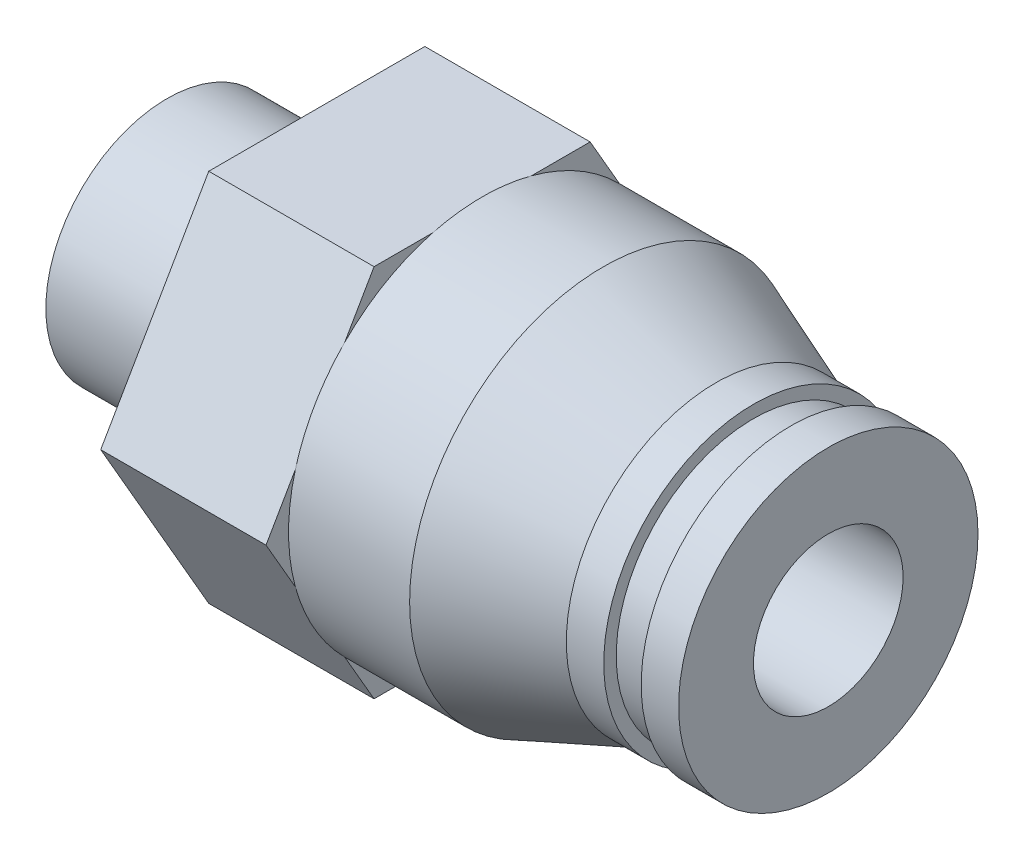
ISO-10303-21;
HEADER;
FILE_DESCRIPTION(('STEP AP214'),'2;1');
FILE_NAME('part.step','',(''),(''),'','','');
FILE_SCHEMA(('AUTOMOTIVE_DESIGN { 1 0 10303 214 1 1 1 1 }'));
ENDSEC;
DATA;
#1=APPLICATION_CONTEXT('core data for automotive mechanical design processes');
#2=APPLICATION_PROTOCOL_DEFINITION('international standard','automotive_design',2000,#1);
#3=PRODUCT_CONTEXT('',#1,'mechanical');
#4=PRODUCT('Part','Part','',(#3));
#5=PRODUCT_RELATED_PRODUCT_CATEGORY('part','',(#4));
#6=PRODUCT_DEFINITION_FORMATION('','',#4);
#7=PRODUCT_DEFINITION_CONTEXT('part definition',#1,'design');
#8=PRODUCT_DEFINITION('design','',#6,#7);
#9=PRODUCT_DEFINITION_SHAPE('','',#8);
#10=(LENGTH_UNIT() NAMED_UNIT(*) SI_UNIT(.MILLI.,.METRE.));
#11=(NAMED_UNIT(*) PLANE_ANGLE_UNIT() SI_UNIT($,.RADIAN.));
#12=(NAMED_UNIT(*) SI_UNIT($,.STERADIAN.) SOLID_ANGLE_UNIT());
#13=UNCERTAINTY_MEASURE_WITH_UNIT(LENGTH_MEASURE(1.E-05),#10,'distance_accuracy_value','');
#14=(GEOMETRIC_REPRESENTATION_CONTEXT(3) GLOBAL_UNCERTAINTY_ASSIGNED_CONTEXT((#13)) GLOBAL_UNIT_ASSIGNED_CONTEXT((#10,
#11,#12)) REPRESENTATION_CONTEXT('',''));
#15=CARTESIAN_POINT('',(0.,0.,0.));
#16=DIRECTION('',(0.,0.,1.));
#17=DIRECTION('',(1.,0.,0.));
#18=AXIS2_PLACEMENT_3D('',#15,#16,#17);
#19=CARTESIAN_POINT('',(6.,4.86,0.));
#20=DIRECTION('',(-1.,0.,0.));
#21=DIRECTION('',(0.,0.,1.));
#22=AXIS2_PLACEMENT_3D('',#19,#20,#21);
#23=PLANE('',#22);
#24=CARTESIAN_POINT('',(6.,0.,0.));
#25=DIRECTION('',(1.,0.,0.));
#26=DIRECTION('',(0.,0.,-1.));
#27=AXIS2_PLACEMENT_3D('',#24,#25,#26);
#28=CIRCLE('',#27,4.86);
#29=CARTESIAN_POINT('',(6.,0.,-4.86));
#30=VERTEX_POINT('',#29);
#31=EDGE_CURVE('E279',#30,#30,#28,.T.);
#32=ORIENTED_EDGE('',*,*,#31,.T.);
#33=EDGE_LOOP('',(#32));
#34=FACE_BOUND('',#33,.T.);
#35=DIRECTION('',(0.,-0.866025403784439,0.5));
#36=VECTOR('',#35,1.);
#37=CARTESIAN_POINT('',(6.,0.,-8.66025403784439));
#38=LINE('',#37,#36);
#39=CARTESIAN_POINT('',(6.,0.,-8.66025403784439));
#40=VERTEX_POINT('',#39);
#41=CARTESIAN_POINT('',(6.,-7.5,-4.33012701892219));
#42=VERTEX_POINT('',#41);
#43=EDGE_CURVE('E173',#40,#42,#38,.T.);
#44=ORIENTED_EDGE('',*,*,#43,.T.);
#45=DIRECTION('',(0.,0.,1.));
#46=VECTOR('',#45,1.);
#47=CARTESIAN_POINT('',(6.,-7.5,-4.33012701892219));
#48=LINE('',#47,#46);
#49=CARTESIAN_POINT('',(6.,-7.5,4.3301270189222));
#50=VERTEX_POINT('',#49);
#51=EDGE_CURVE('E155',#42,#50,#48,.T.);
#52=ORIENTED_EDGE('',*,*,#51,.T.);
#53=DIRECTION('',(0.,0.866025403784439,0.5));
#54=VECTOR('',#53,1.);
#55=CARTESIAN_POINT('',(6.,-7.5,4.3301270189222));
#56=LINE('',#55,#54);
#57=CARTESIAN_POINT('',(6.,0.,8.66025403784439));
#58=VERTEX_POINT('',#57);
#59=EDGE_CURVE('E167',#50,#58,#56,.T.);
#60=ORIENTED_EDGE('',*,*,#59,.T.);
#61=DIRECTION('',(0.,0.866025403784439,-0.5));
#62=VECTOR('',#61,1.);
#63=CARTESIAN_POINT('',(6.,0.,8.66025403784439));
#64=LINE('',#63,#62);
#65=CARTESIAN_POINT('',(6.,7.5,4.33012701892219));
#66=VERTEX_POINT('',#65);
#67=EDGE_CURVE('E39',#58,#66,#64,.T.);
#68=ORIENTED_EDGE('',*,*,#67,.T.);
#69=DIRECTION('',(0.,0.,-1.));
#70=VECTOR('',#69,1.);
#71=CARTESIAN_POINT('',(6.,7.5,4.33012701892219));
#72=LINE('',#71,#70);
#73=CARTESIAN_POINT('',(6.,7.5,-4.3301270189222));
#74=VERTEX_POINT('',#73);
#75=EDGE_CURVE('E177',#66,#74,#72,.T.);
#76=ORIENTED_EDGE('',*,*,#75,.T.);
#77=DIRECTION('',(0.,-0.866025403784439,-0.5));
#78=VECTOR('',#77,1.);
#79=CARTESIAN_POINT('',(6.,7.5,-4.3301270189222));
#80=LINE('',#79,#78);
#81=EDGE_CURVE('E180',#74,#40,#80,.T.);
#82=ORIENTED_EDGE('',*,*,#81,.T.);
#83=EDGE_LOOP('',(#44,#52,#60,#68,#76,#82));
#84=FACE_BOUND('',#83,.T.);
#85=ADVANCED_FACE('F24',(#34,#84),#23,.T.);
#86=CARTESIAN_POINT('',(12.625,9.5,0.));
#87=DIRECTION('',(1.,0.,0.));
#88=DIRECTION('',(0.,0.,-1.));
#89=AXIS2_PLACEMENT_3D('',#86,#87,#88);
#90=PLANE('',#89);
#91=CARTESIAN_POINT('',(12.625,0.,0.));
#92=DIRECTION('',(1.,0.,0.));
#93=DIRECTION('',(0.,0.,-1.));
#94=AXIS2_PLACEMENT_3D('',#91,#92,#93);
#95=CIRCLE('',#94,7.75688111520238);
#96=CARTESIAN_POINT('',(12.625,-7.5,-1.97969811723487));
#97=VERTEX_POINT('',#96);
#98=CARTESIAN_POINT('',(12.625,-5.46446886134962,-5.50534146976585));
#99=VERTEX_POINT('',#98);
#100=EDGE_CURVE('E390',#97,#99,#95,.T.);
#101=ORIENTED_EDGE('',*,*,#100,.F.);
#102=DIRECTION('',(0.,0.,1.));
#103=VECTOR('',#102,1.);
#104=CARTESIAN_POINT('',(12.625,-7.5,-4.33012701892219));
#105=LINE('',#104,#103);
#106=CARTESIAN_POINT('',(12.625,-7.5,-4.33012701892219));
#107=VERTEX_POINT('',#106);
#108=EDGE_CURVE('E183',#107,#97,#105,.T.);
#109=ORIENTED_EDGE('',*,*,#108,.F.);
#110=DIRECTION('',(0.,-0.866025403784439,0.5));
#111=VECTOR('',#110,1.);
#112=CARTESIAN_POINT('',(12.625,0.,-8.66025403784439));
#113=LINE('',#112,#111);
#114=EDGE_CURVE('E203',#99,#107,#113,.T.);
#115=ORIENTED_EDGE('',*,*,#114,.F.);
#116=EDGE_LOOP('',(#101,#109,#115));
#117=FACE_BOUND('',#116,.T.);
#118=ADVANCED_FACE('F334',(#117),#90,.T.);
#119=CARTESIAN_POINT('',(12.625,-2.03553113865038,-7.48503958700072));
#120=VERTEX_POINT('',#119);
#121=CARTESIAN_POINT('',(12.625,2.03553113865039,-7.48503958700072));
#122=VERTEX_POINT('',#121);
#123=EDGE_CURVE('E275',#120,#122,#95,.T.);
#124=ORIENTED_EDGE('',*,*,#123,.F.);
#125=CARTESIAN_POINT('',(12.625,0.,-8.66025403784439));
#126=VERTEX_POINT('',#125);
#127=EDGE_CURVE('E164',#126,#120,#113,.T.);
#128=ORIENTED_EDGE('',*,*,#127,.F.);
#129=DIRECTION('',(0.,-0.866025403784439,-0.5));
#130=VECTOR('',#129,1.);
#131=CARTESIAN_POINT('',(12.625,7.5,-4.3301270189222));
#132=LINE('',#131,#130);
#133=EDGE_CURVE('E198',#122,#126,#132,.T.);
#134=ORIENTED_EDGE('',*,*,#133,.F.);
#135=EDGE_LOOP('',(#124,#128,#134));
#136=FACE_BOUND('',#135,.T.);
#137=ADVANCED_FACE('F340',(#136),#90,.T.);
#138=CARTESIAN_POINT('',(12.625,5.46446886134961,-5.50534146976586));
#139=VERTEX_POINT('',#138);
#140=CARTESIAN_POINT('',(12.625,7.5,-1.97969811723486));
#141=VERTEX_POINT('',#140);
#142=EDGE_CURVE('E280',#139,#141,#95,.T.);
#143=ORIENTED_EDGE('',*,*,#142,.F.);
#144=CARTESIAN_POINT('',(12.625,7.5,-4.3301270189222));
#145=VERTEX_POINT('',#144);
#146=EDGE_CURVE('E200',#145,#139,#132,.T.);
#147=ORIENTED_EDGE('',*,*,#146,.F.);
#148=DIRECTION('',(0.,0.,-1.));
#149=VECTOR('',#148,1.);
#150=CARTESIAN_POINT('',(12.625,7.5,4.33012701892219));
#151=LINE('',#150,#149);
#152=EDGE_CURVE('E193',#141,#145,#151,.T.);
#153=ORIENTED_EDGE('',*,*,#152,.F.);
#154=EDGE_LOOP('',(#143,#147,#153));
#155=FACE_BOUND('',#154,.T.);
#156=ADVANCED_FACE('F452',(#155),#90,.T.);
#157=CARTESIAN_POINT('',(12.625,7.5,1.97969811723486));
#158=VERTEX_POINT('',#157);
#159=CARTESIAN_POINT('',(12.625,5.46446886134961,5.50534146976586));
#160=VERTEX_POINT('',#159);
#161=EDGE_CURVE('E387',#158,#160,#95,.T.);
#162=ORIENTED_EDGE('',*,*,#161,.F.);
#163=CARTESIAN_POINT('',(12.625,7.5,4.33012701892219));
#164=VERTEX_POINT('',#163);
#165=EDGE_CURVE('E195',#164,#158,#151,.T.);
#166=ORIENTED_EDGE('',*,*,#165,.F.);
#167=DIRECTION('',(0.,0.866025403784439,-0.5));
#168=VECTOR('',#167,1.);
#169=CARTESIAN_POINT('',(12.625,0.,8.66025403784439));
#170=LINE('',#169,#168);
#171=EDGE_CURVE('E190',#160,#164,#170,.T.);
#172=ORIENTED_EDGE('',*,*,#171,.F.);
#173=EDGE_LOOP('',(#162,#166,#172));
#174=FACE_BOUND('',#173,.T.);
#175=ADVANCED_FACE('F370',(#174),#90,.T.);
#176=CARTESIAN_POINT('',(12.625,2.03553113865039,7.48503958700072));
#177=VERTEX_POINT('',#176);
#178=CARTESIAN_POINT('',(12.625,-2.03553113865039,7.48503958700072));
#179=VERTEX_POINT('',#178);
#180=EDGE_CURVE('E381',#177,#179,#95,.T.);
#181=ORIENTED_EDGE('',*,*,#180,.F.);
#182=CARTESIAN_POINT('',(12.625,0.,8.66025403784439));
#183=VERTEX_POINT('',#182);
#184=EDGE_CURVE('E45',#183,#177,#170,.T.);
#185=ORIENTED_EDGE('',*,*,#184,.F.);
#186=DIRECTION('',(0.,0.866025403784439,0.5));
#187=VECTOR('',#186,1.);
#188=CARTESIAN_POINT('',(12.625,-7.5,4.3301270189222));
#189=LINE('',#188,#187);
#190=EDGE_CURVE('E186',#179,#183,#189,.T.);
#191=ORIENTED_EDGE('',*,*,#190,.F.);
#192=EDGE_LOOP('',(#181,#185,#191));
#193=FACE_BOUND('',#192,.T.);
#194=ADVANCED_FACE('F365',(#193),#90,.T.);
#195=CARTESIAN_POINT('',(12.625,-7.5,4.3301270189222));
#196=VERTEX_POINT('',#195);
#197=CARTESIAN_POINT('',(12.625,-5.46446886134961,5.50534146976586));
#198=VERTEX_POINT('',#197);
#199=EDGE_CURVE('E188',#196,#198,#189,.T.);
#200=ORIENTED_EDGE('',*,*,#199,.F.);
#201=CARTESIAN_POINT('',(12.625,-7.5,1.97969811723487));
#202=VERTEX_POINT('',#201);
#203=EDGE_CURVE('E159',#202,#196,#105,.T.);
#204=ORIENTED_EDGE('',*,*,#203,.F.);
#205=EDGE_CURVE('E374',#198,#202,#95,.T.);
#206=ORIENTED_EDGE('',*,*,#205,.F.);
#207=EDGE_LOOP('',(#200,#204,#206));
#208=FACE_BOUND('',#207,.T.);
#209=ADVANCED_FACE('F343',(#208),#90,.T.);
#210=CARTESIAN_POINT('',(0.,0.,0.));
#211=DIRECTION('',(-1.,0.,0.));
#212=DIRECTION('',(0.,0.,1.));
#213=AXIS2_PLACEMENT_3D('',#210,#211,#212);
#214=PLANE('',#213);
#215=CARTESIAN_POINT('',(0.,0.,0.));
#216=DIRECTION('',(1.,0.,0.));
#217=DIRECTION('',(0.,0.,-1.));
#218=AXIS2_PLACEMENT_3D('',#215,#216,#217);
#219=CIRCLE('',#218,4.86);
#220=CARTESIAN_POINT('',(0.,0.,-4.86));
#221=VERTEX_POINT('',#220);
#222=EDGE_CURVE('E283',#221,#221,#219,.T.);
#223=ORIENTED_EDGE('',*,*,#222,.F.);
#224=EDGE_LOOP('',(#223));
#225=FACE_BOUND('',#224,.T.);
#226=DIRECTION('',(0.,-0.866025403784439,-0.5));
#227=VECTOR('',#226,1.);
#228=CARTESIAN_POINT('',(0.,0.,2.88675134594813));
#229=LINE('',#228,#227);
#230=CARTESIAN_POINT('',(0.,0.,2.88675134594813));
#231=VERTEX_POINT('',#230);
#232=CARTESIAN_POINT('',(0.,-2.5,1.44337567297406));
#233=VERTEX_POINT('',#232);
#234=EDGE_CURVE('E232',#231,#233,#229,.T.);
#235=ORIENTED_EDGE('',*,*,#234,.T.);
#236=DIRECTION('',(0.,0.,-1.));
#237=VECTOR('',#236,1.);
#238=CARTESIAN_POINT('',(0.,-2.5,1.44337567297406));
#239=LINE('',#238,#237);
#240=CARTESIAN_POINT('',(0.,-2.5,-1.44337567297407));
#241=VERTEX_POINT('',#240);
#242=EDGE_CURVE('E210',#233,#241,#239,.T.);
#243=ORIENTED_EDGE('',*,*,#242,.T.);
#244=DIRECTION('',(0.,0.866025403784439,-0.5));
#245=VECTOR('',#244,1.);
#246=CARTESIAN_POINT('',(0.,-2.5,-1.44337567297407));
#247=LINE('',#246,#245);
#248=CARTESIAN_POINT('',(0.,0.,-2.88675134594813));
#249=VERTEX_POINT('',#248);
#250=EDGE_CURVE('E220',#241,#249,#247,.T.);
#251=ORIENTED_EDGE('',*,*,#250,.T.);
#252=DIRECTION('',(0.,0.866025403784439,0.5));
#253=VECTOR('',#252,1.);
#254=CARTESIAN_POINT('',(0.,0.,-2.88675134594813));
#255=LINE('',#254,#253);
#256=CARTESIAN_POINT('',(0.,2.5,-1.44337567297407));
#257=VERTEX_POINT('',#256);
#258=EDGE_CURVE('E223',#249,#257,#255,.T.);
#259=ORIENTED_EDGE('',*,*,#258,.T.);
#260=DIRECTION('',(0.,0.,1.));
#261=VECTOR('',#260,1.);
#262=CARTESIAN_POINT('',(0.,2.5,-1.44337567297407));
#263=LINE('',#262,#261);
#264=CARTESIAN_POINT('',(0.,2.5,1.44337567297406));
#265=VERTEX_POINT('',#264);
#266=EDGE_CURVE('E226',#257,#265,#263,.T.);
#267=ORIENTED_EDGE('',*,*,#266,.T.);
#268=DIRECTION('',(0.,-0.866025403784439,0.5));
#269=VECTOR('',#268,1.);
#270=CARTESIAN_POINT('',(0.,2.5,1.44337567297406));
#271=LINE('',#270,#269);
#272=EDGE_CURVE('E229',#265,#231,#271,.T.);
#273=ORIENTED_EDGE('',*,*,#272,.T.);
#274=EDGE_LOOP('',(#235,#243,#251,#259,#267,#273));
#275=FACE_BOUND('',#274,.T.);
#276=ADVANCED_FACE('F26',(#225,#275),#214,.T.);
#277=CARTESIAN_POINT('',(9.,3.,0.));
#278=DIRECTION('',(1.,0.,0.));
#279=DIRECTION('',(0.,0.,-1.));
#280=AXIS2_PLACEMENT_3D('',#277,#278,#279);
#281=PLANE('',#280);
#282=CARTESIAN_POINT('',(9.,0.,0.));
#283=DIRECTION('',(1.,0.,0.));
#284=DIRECTION('',(0.,0.,-1.));
#285=AXIS2_PLACEMENT_3D('',#282,#283,#284);
#286=CIRCLE('',#285,3.);
#287=CARTESIAN_POINT('',(9.,0.,-3.));
#288=VERTEX_POINT('',#287);
#289=EDGE_CURVE('E248',#288,#288,#286,.T.);
#290=ORIENTED_EDGE('',*,*,#289,.T.);
#291=EDGE_LOOP('',(#290));
#292=FACE_BOUND('',#291,.T.);
#293=DIRECTION('',(0.,-0.866025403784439,0.5));
#294=VECTOR('',#293,1.);
#295=CARTESIAN_POINT('',(9.,1.,-3.46410161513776));
#296=LINE('',#295,#294);
#297=CARTESIAN_POINT('',(9.,0.,-2.88675134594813));
#298=VERTEX_POINT('',#297);
#299=CARTESIAN_POINT('',(9.,-2.5,-1.44337567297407));
#300=VERTEX_POINT('',#299);
#301=EDGE_CURVE('E32',#298,#300,#296,.T.);
#302=ORIENTED_EDGE('',*,*,#301,.T.);
#303=DIRECTION('',(0.,0.,1.));
#304=VECTOR('',#303,1.);
#305=CARTESIAN_POINT('',(9.,-2.5,0.));
#306=LINE('',#305,#304);
#307=CARTESIAN_POINT('',(9.,-2.5,1.44337567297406));
#308=VERTEX_POINT('',#307);
#309=EDGE_CURVE('E13',#300,#308,#306,.T.);
#310=ORIENTED_EDGE('',*,*,#309,.T.);
#311=DIRECTION('',(0.,0.866025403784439,0.5));
#312=VECTOR('',#311,1.);
#313=CARTESIAN_POINT('',(9.,1.,3.46410161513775));
#314=LINE('',#313,#312);
#315=CARTESIAN_POINT('',(9.,0.,2.88675134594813));
#316=VERTEX_POINT('',#315);
#317=EDGE_CURVE('E286',#308,#316,#314,.T.);
#318=ORIENTED_EDGE('',*,*,#317,.T.);
#319=DIRECTION('',(0.,0.866025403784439,-0.5));
#320=VECTOR('',#319,1.);
#321=CARTESIAN_POINT('',(9.,3.5,0.866025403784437));
#322=LINE('',#321,#320);
#323=CARTESIAN_POINT('',(9.,2.5,1.44337567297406));
#324=VERTEX_POINT('',#323);
#325=EDGE_CURVE('E289',#316,#324,#322,.T.);
#326=ORIENTED_EDGE('',*,*,#325,.T.);
#327=DIRECTION('',(0.,0.,-1.));
#328=VECTOR('',#327,1.);
#329=CARTESIAN_POINT('',(9.,2.5,0.));
#330=LINE('',#329,#328);
#331=CARTESIAN_POINT('',(9.,2.5,-1.44337567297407));
#332=VERTEX_POINT('',#331);
#333=EDGE_CURVE('E292',#324,#332,#330,.T.);
#334=ORIENTED_EDGE('',*,*,#333,.T.);
#335=DIRECTION('',(0.,-0.866025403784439,-0.5));
#336=VECTOR('',#335,1.);
#337=CARTESIAN_POINT('',(9.,3.5,-0.866025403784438));
#338=LINE('',#337,#336);
#339=EDGE_CURVE('E295',#332,#298,#338,.T.);
#340=ORIENTED_EDGE('',*,*,#339,.T.);
#341=EDGE_LOOP('',(#302,#310,#318,#326,#334,#340));
#342=FACE_BOUND('',#341,.T.);
#343=ADVANCED_FACE('F299',(#292,#342),#281,.T.);
#344=CARTESIAN_POINT('',(0.,0.,0.));
#345=DIRECTION('',(1.,0.,0.));
#346=DIRECTION('',(0.,0.,-1.));
#347=AXIS2_PLACEMENT_3D('',#344,#345,#346);
#348=CYLINDRICAL_SURFACE('',#347,4.86);
#349=ORIENTED_EDGE('',*,*,#222,.T.);
#350=EDGE_LOOP('',(#349));
#351=FACE_BOUND('',#350,.T.);
#352=ORIENTED_EDGE('',*,*,#31,.F.);
#353=EDGE_LOOP('',(#352));
#354=FACE_BOUND('',#353,.T.);
#355=ADVANCED_FACE('F345',(#351,#354),#348,.T.);
#356=CARTESIAN_POINT('',(0.,0.,0.));
#357=DIRECTION('',(1.,0.,0.));
#358=DIRECTION('',(0.,0.,-1.));
#359=AXIS2_PLACEMENT_3D('',#356,#357,#358);
#360=CYLINDRICAL_SURFACE('',#359,7.75688111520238);
#361=EDGE_CURVE('E276',#122,#139,#95,.T.);
#362=ORIENTED_EDGE('',*,*,#361,.T.);
#363=ORIENTED_EDGE('',*,*,#142,.T.);
#364=EDGE_CURVE('E454',#141,#158,#95,.T.);
#365=ORIENTED_EDGE('',*,*,#364,.T.);
#366=ORIENTED_EDGE('',*,*,#161,.T.);
#367=EDGE_CURVE('E386',#160,#177,#95,.T.);
#368=ORIENTED_EDGE('',*,*,#367,.T.);
#369=ORIENTED_EDGE('',*,*,#180,.T.);
#370=EDGE_CURVE('E384',#179,#198,#95,.T.);
#371=ORIENTED_EDGE('',*,*,#370,.T.);
#372=ORIENTED_EDGE('',*,*,#205,.T.);
#373=EDGE_CURVE('E388',#202,#97,#95,.T.);
#374=ORIENTED_EDGE('',*,*,#373,.T.);
#375=ORIENTED_EDGE('',*,*,#100,.T.);
#376=EDGE_CURVE('E392',#99,#120,#95,.T.);
#377=ORIENTED_EDGE('',*,*,#376,.T.);
#378=ORIENTED_EDGE('',*,*,#123,.T.);
#379=EDGE_LOOP('',(#362,#363,#365,#366,#368,#369,#371,#372,#374,#375,#377,#378));
#380=FACE_BOUND('',#379,.T.);
#381=CARTESIAN_POINT('',(17.4771203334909,0.,0.));
#382=DIRECTION('',(1.,0.,0.));
#383=DIRECTION('',(0.,0.,-1.));
#384=AXIS2_PLACEMENT_3D('',#381,#382,#383);
#385=CIRCLE('',#384,7.75688111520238);
#386=CARTESIAN_POINT('',(17.4771203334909,0.,-7.75688111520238));
#387=VERTEX_POINT('',#386);
#388=EDGE_CURVE('E272',#387,#387,#385,.T.);
#389=ORIENTED_EDGE('',*,*,#388,.F.);
#390=EDGE_LOOP('',(#389));
#391=FACE_BOUND('',#390,.T.);
#392=ADVANCED_FACE('F347',(#380,#391),#360,.T.);
#393=CARTESIAN_POINT('',(22.,0.,0.));
#394=DIRECTION('',(-1.,0.,0.));
#395=DIRECTION('',(0.,0.,1.));
#396=AXIS2_PLACEMENT_3D('',#393,#394,#395);
#397=CONICAL_SURFACE('',#396,6.,0.370503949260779);
#398=ORIENTED_EDGE('',*,*,#388,.T.);
#399=EDGE_LOOP('',(#398));
#400=FACE_BOUND('',#399,.T.);
#401=CARTESIAN_POINT('',(22.,0.,0.));
#402=DIRECTION('',(1.,0.,0.));
#403=DIRECTION('',(0.,0.,-1.));
#404=AXIS2_PLACEMENT_3D('',#401,#402,#403);
#405=CIRCLE('',#404,6.);
#406=CARTESIAN_POINT('',(22.,0.,-6.));
#407=VERTEX_POINT('',#406);
#408=EDGE_CURVE('E269',#407,#407,#405,.T.);
#409=ORIENTED_EDGE('',*,*,#408,.F.);
#410=EDGE_LOOP('',(#409));
#411=FACE_BOUND('',#410,.T.);
#412=ADVANCED_FACE('F353',(#400,#411),#397,.T.);
#413=CARTESIAN_POINT('',(0.,0.,0.));
#414=DIRECTION('',(1.,0.,0.));
#415=DIRECTION('',(0.,0.,-1.));
#416=AXIS2_PLACEMENT_3D('',#413,#414,#415);
#417=CYLINDRICAL_SURFACE('',#416,6.);
#418=ORIENTED_EDGE('',*,*,#408,.T.);
#419=EDGE_LOOP('',(#418));
#420=FACE_BOUND('',#419,.T.);
#421=CARTESIAN_POINT('',(23.5,0.,0.));
#422=DIRECTION('',(1.,0.,0.));
#423=DIRECTION('',(0.,0.,-1.));
#424=AXIS2_PLACEMENT_3D('',#421,#422,#423);
#425=CIRCLE('',#424,6.);
#426=CARTESIAN_POINT('',(23.5,0.,-6.));
#427=VERTEX_POINT('',#426);
#428=EDGE_CURVE('E266',#427,#427,#425,.T.);
#429=ORIENTED_EDGE('',*,*,#428,.F.);
#430=EDGE_LOOP('',(#429));
#431=FACE_BOUND('',#430,.T.);
#432=ADVANCED_FACE('F615',(#420,#431),#417,.T.);
#433=CARTESIAN_POINT('',(23.5,6.,0.));
#434=DIRECTION('',(1.,0.,0.));
#435=DIRECTION('',(0.,0.,-1.));
#436=AXIS2_PLACEMENT_3D('',#433,#434,#435);
#437=PLANE('',#436);
#438=ORIENTED_EDGE('',*,*,#428,.T.);
#439=EDGE_LOOP('',(#438));
#440=FACE_BOUND('',#439,.T.);
#441=CARTESIAN_POINT('',(23.5,0.,0.));
#442=DIRECTION('',(1.,0.,0.));
#443=DIRECTION('',(0.,0.,-1.));
#444=AXIS2_PLACEMENT_3D('',#441,#442,#443);
#445=CIRCLE('',#444,5.5);
#446=CARTESIAN_POINT('',(23.5,0.,-5.5));
#447=VERTEX_POINT('',#446);
#448=EDGE_CURVE('E263',#447,#447,#445,.T.);
#449=ORIENTED_EDGE('',*,*,#448,.F.);
#450=EDGE_LOOP('',(#449));
#451=FACE_BOUND('',#450,.T.);
#452=ADVANCED_FACE('F605',(#440,#451),#437,.T.);
#453=CARTESIAN_POINT('',(0.,0.,0.));
#454=DIRECTION('',(1.,0.,0.));
#455=DIRECTION('',(0.,0.,-1.));
#456=AXIS2_PLACEMENT_3D('',#453,#454,#455);
#457=CYLINDRICAL_SURFACE('',#456,5.5);
#458=ORIENTED_EDGE('',*,*,#448,.T.);
#459=EDGE_LOOP('',(#458));
#460=FACE_BOUND('',#459,.T.);
#461=CARTESIAN_POINT('',(25.,0.,0.));
#462=DIRECTION('',(1.,0.,0.));
#463=DIRECTION('',(0.,0.,-1.));
#464=AXIS2_PLACEMENT_3D('',#461,#462,#463);
#465=CIRCLE('',#464,5.5);
#466=CARTESIAN_POINT('',(25.,0.,-5.5));
#467=VERTEX_POINT('',#466);
#468=EDGE_CURVE('E260',#467,#467,#465,.T.);
#469=ORIENTED_EDGE('',*,*,#468,.F.);
#470=EDGE_LOOP('',(#469));
#471=FACE_BOUND('',#470,.T.);
#472=ADVANCED_FACE('F594',(#460,#471),#457,.T.);
#473=CARTESIAN_POINT('',(25.,5.5,0.));
#474=DIRECTION('',(-1.,0.,0.));
#475=DIRECTION('',(0.,0.,1.));
#476=AXIS2_PLACEMENT_3D('',#473,#474,#475);
#477=PLANE('',#476);
#478=ORIENTED_EDGE('',*,*,#468,.T.);
#479=EDGE_LOOP('',(#478));
#480=FACE_BOUND('',#479,.T.);
#481=CARTESIAN_POINT('',(25.,0.,0.));
#482=DIRECTION('',(1.,0.,0.));
#483=DIRECTION('',(0.,0.,-1.));
#484=AXIS2_PLACEMENT_3D('',#481,#482,#483);
#485=CIRCLE('',#484,6.);
#486=CARTESIAN_POINT('',(25.,0.,-6.));
#487=VERTEX_POINT('',#486);
#488=EDGE_CURVE('E257',#487,#487,#485,.T.);
#489=ORIENTED_EDGE('',*,*,#488,.F.);
#490=EDGE_LOOP('',(#489));
#491=FACE_BOUND('',#490,.T.);
#492=ADVANCED_FACE('F583',(#480,#491),#477,.T.);
#493=CARTESIAN_POINT('',(0.,0.,0.));
#494=DIRECTION('',(1.,0.,0.));
#495=DIRECTION('',(0.,0.,-1.));
#496=AXIS2_PLACEMENT_3D('',#493,#494,#495);
#497=CYLINDRICAL_SURFACE('',#496,6.);
#498=ORIENTED_EDGE('',*,*,#488,.T.);
#499=EDGE_LOOP('',(#498));
#500=FACE_BOUND('',#499,.T.);
#501=CARTESIAN_POINT('',(26.5,0.,0.));
#502=DIRECTION('',(1.,0.,0.));
#503=DIRECTION('',(0.,0.,-1.));
#504=AXIS2_PLACEMENT_3D('',#501,#502,#503);
#505=CIRCLE('',#504,6.);
#506=CARTESIAN_POINT('',(26.5,0.,-6.));
#507=VERTEX_POINT('',#506);
#508=EDGE_CURVE('E254',#507,#507,#505,.T.);
#509=ORIENTED_EDGE('',*,*,#508,.F.);
#510=EDGE_LOOP('',(#509));
#511=FACE_BOUND('',#510,.T.);
#512=ADVANCED_FACE('F573',(#500,#511),#497,.T.);
#513=CARTESIAN_POINT('',(26.5,6.,0.));
#514=DIRECTION('',(1.,0.,0.));
#515=DIRECTION('',(0.,0.,-1.));
#516=AXIS2_PLACEMENT_3D('',#513,#514,#515);
#517=PLANE('',#516);
#518=ORIENTED_EDGE('',*,*,#508,.T.);
#519=EDGE_LOOP('',(#518));
#520=FACE_BOUND('',#519,.T.);
#521=CARTESIAN_POINT('',(26.5,0.,0.));
#522=DIRECTION('',(1.,0.,0.));
#523=DIRECTION('',(0.,0.,-1.));
#524=AXIS2_PLACEMENT_3D('',#521,#522,#523);
#525=CIRCLE('',#524,3.);
#526=CARTESIAN_POINT('',(26.5,0.,-3.));
#527=VERTEX_POINT('',#526);
#528=EDGE_CURVE('E251',#527,#527,#525,.T.);
#529=ORIENTED_EDGE('',*,*,#528,.F.);
#530=EDGE_LOOP('',(#529));
#531=FACE_BOUND('',#530,.T.);
#532=ADVANCED_FACE('F560',(#520,#531),#517,.T.);
#533=CARTESIAN_POINT('',(0.,0.,0.));
#534=DIRECTION('',(1.,0.,0.));
#535=DIRECTION('',(0.,0.,-1.));
#536=AXIS2_PLACEMENT_3D('',#533,#534,#535);
#537=CYLINDRICAL_SURFACE('',#536,3.);
#538=ORIENTED_EDGE('',*,*,#528,.T.);
#539=EDGE_LOOP('',(#538));
#540=FACE_BOUND('',#539,.T.);
#541=ORIENTED_EDGE('',*,*,#289,.F.);
#542=EDGE_LOOP('',(#541));
#543=FACE_BOUND('',#542,.T.);
#544=ADVANCED_FACE('F550',(#540,#543),#537,.F.);
#545=CARTESIAN_POINT('',(26.5,-2.5,1.44337567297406));
#546=DIRECTION('',(0.,1.,0.));
#547=DIRECTION('',(0.,0.,1.));
#548=AXIS2_PLACEMENT_3D('',#545,#546,#547);
#549=PLANE('',#548);
#550=DIRECTION('',(-1.,0.,0.));
#551=VECTOR('',#550,1.);
#552=CARTESIAN_POINT('',(26.5,-2.5,-1.44337567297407));
#553=LINE('',#552,#551);
#554=EDGE_CURVE('E246',#300,#241,#553,.T.);
#555=ORIENTED_EDGE('',*,*,#554,.T.);
#556=ORIENTED_EDGE('',*,*,#242,.F.);
#557=DIRECTION('',(-1.,0.,0.));
#558=VECTOR('',#557,1.);
#559=CARTESIAN_POINT('',(26.5,-2.5,1.44337567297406));
#560=LINE('',#559,#558);
#561=EDGE_CURVE('E235',#308,#233,#560,.T.);
#562=ORIENTED_EDGE('',*,*,#561,.F.);
#563=ORIENTED_EDGE('',*,*,#309,.F.);
#564=EDGE_LOOP('',(#555,#556,#562,#563));
#565=FACE_BOUND('',#564,.T.);
#566=ADVANCED_FACE('F314',(#565),#549,.T.);
#567=CARTESIAN_POINT('',(26.5,-2.5,-1.44337567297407));
#568=DIRECTION('',(0.,0.5,0.866025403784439));
#569=DIRECTION('',(0.,-0.866025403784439,0.5));
#570=AXIS2_PLACEMENT_3D('',#567,#568,#569);
#571=PLANE('',#570);
#572=DIRECTION('',(-1.,0.,0.));
#573=VECTOR('',#572,1.);
#574=CARTESIAN_POINT('',(26.5,0.,-2.88675134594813));
#575=LINE('',#574,#573);
#576=EDGE_CURVE('E244',#298,#249,#575,.T.);
#577=ORIENTED_EDGE('',*,*,#576,.T.);
#578=ORIENTED_EDGE('',*,*,#250,.F.);
#579=ORIENTED_EDGE('',*,*,#554,.F.);
#580=ORIENTED_EDGE('',*,*,#301,.F.);
#581=EDGE_LOOP('',(#577,#578,#579,#580));
#582=FACE_BOUND('',#581,.T.);
#583=ADVANCED_FACE('F303',(#582),#571,.T.);
#584=CARTESIAN_POINT('',(26.5,0.,-2.88675134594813));
#585=DIRECTION('',(0.,-0.5,0.866025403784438));
#586=DIRECTION('',(0.,-0.866025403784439,-0.5));
#587=AXIS2_PLACEMENT_3D('',#584,#585,#586);
#588=PLANE('',#587);
#589=DIRECTION('',(-1.,0.,0.));
#590=VECTOR('',#589,1.);
#591=CARTESIAN_POINT('',(26.5,2.5,-1.44337567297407));
#592=LINE('',#591,#590);
#593=EDGE_CURVE('E242',#332,#257,#592,.T.);
#594=ORIENTED_EDGE('',*,*,#593,.T.);
#595=ORIENTED_EDGE('',*,*,#258,.F.);
#596=ORIENTED_EDGE('',*,*,#576,.F.);
#597=ORIENTED_EDGE('',*,*,#339,.F.);
#598=EDGE_LOOP('',(#594,#595,#596,#597));
#599=FACE_BOUND('',#598,.T.);
#600=ADVANCED_FACE('F307',(#599),#588,.T.);
#601=CARTESIAN_POINT('',(26.5,2.5,-1.44337567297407));
#602=DIRECTION('',(0.,-1.,0.));
#603=DIRECTION('',(0.,0.,-1.));
#604=AXIS2_PLACEMENT_3D('',#601,#602,#603);
#605=PLANE('',#604);
#606=DIRECTION('',(-1.,0.,0.));
#607=VECTOR('',#606,1.);
#608=CARTESIAN_POINT('',(26.5,2.5,1.44337567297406));
#609=LINE('',#608,#607);
#610=EDGE_CURVE('E240',#324,#265,#609,.T.);
#611=ORIENTED_EDGE('',*,*,#610,.T.);
#612=ORIENTED_EDGE('',*,*,#266,.F.);
#613=ORIENTED_EDGE('',*,*,#593,.F.);
#614=ORIENTED_EDGE('',*,*,#333,.F.);
#615=EDGE_LOOP('',(#611,#612,#613,#614));
#616=FACE_BOUND('',#615,.T.);
#617=ADVANCED_FACE('F323',(#616),#605,.T.);
#618=CARTESIAN_POINT('',(26.5,2.5,1.44337567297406));
#619=DIRECTION('',(0.,-0.5,-0.866025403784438));
#620=DIRECTION('',(0.,0.866025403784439,-0.5));
#621=AXIS2_PLACEMENT_3D('',#618,#619,#620);
#622=PLANE('',#621);
#623=DIRECTION('',(-1.,0.,0.));
#624=VECTOR('',#623,1.);
#625=CARTESIAN_POINT('',(26.5,0.,2.88675134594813));
#626=LINE('',#625,#624);
#627=EDGE_CURVE('E238',#316,#231,#626,.T.);
#628=ORIENTED_EDGE('',*,*,#627,.T.);
#629=ORIENTED_EDGE('',*,*,#272,.F.);
#630=ORIENTED_EDGE('',*,*,#610,.F.);
#631=ORIENTED_EDGE('',*,*,#325,.F.);
#632=EDGE_LOOP('',(#628,#629,#630,#631));
#633=FACE_BOUND('',#632,.T.);
#634=ADVANCED_FACE('F320',(#633),#622,.T.);
#635=CARTESIAN_POINT('',(26.5,0.,2.88675134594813));
#636=DIRECTION('',(0.,0.5,-0.866025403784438));
#637=DIRECTION('',(0.,0.866025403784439,0.5));
#638=AXIS2_PLACEMENT_3D('',#635,#636,#637);
#639=PLANE('',#638);
#640=ORIENTED_EDGE('',*,*,#561,.T.);
#641=ORIENTED_EDGE('',*,*,#234,.F.);
#642=ORIENTED_EDGE('',*,*,#627,.F.);
#643=ORIENTED_EDGE('',*,*,#317,.F.);
#644=EDGE_LOOP('',(#640,#641,#642,#643));
#645=FACE_BOUND('',#644,.T.);
#646=ADVANCED_FACE('F316',(#645),#639,.T.);
#647=CARTESIAN_POINT('',(12.625,0.,0.));
#648=DIRECTION('',(-1.,0.,0.));
#649=DIRECTION('',(0.,0.,1.));
#650=AXIS2_PLACEMENT_3D('',#647,#648,#649);
#651=PLANE('',#650);
#652=EDGE_CURVE('E191',#198,#179,#189,.T.);
#653=ORIENTED_EDGE('',*,*,#652,.F.);
#654=ORIENTED_EDGE('',*,*,#370,.F.);
#655=EDGE_LOOP('',(#653,#654));
#656=FACE_BOUND('',#655,.T.);
#657=ADVANCED_FACE('F426',(#656),#651,.T.);
#658=EDGE_CURVE('E187',#97,#202,#105,.T.);
#659=ORIENTED_EDGE('',*,*,#658,.F.);
#660=ORIENTED_EDGE('',*,*,#373,.F.);
#661=EDGE_LOOP('',(#659,#660));
#662=FACE_BOUND('',#661,.T.);
#663=ADVANCED_FACE('F420',(#662),#651,.T.);
#664=EDGE_CURVE('E207',#120,#99,#113,.T.);
#665=ORIENTED_EDGE('',*,*,#664,.F.);
#666=ORIENTED_EDGE('',*,*,#376,.F.);
#667=EDGE_LOOP('',(#665,#666));
#668=FACE_BOUND('',#667,.T.);
#669=ADVANCED_FACE('F412',(#668),#651,.T.);
#670=EDGE_CURVE('E204',#139,#122,#132,.T.);
#671=ORIENTED_EDGE('',*,*,#670,.F.);
#672=ORIENTED_EDGE('',*,*,#361,.F.);
#673=EDGE_LOOP('',(#671,#672));
#674=FACE_BOUND('',#673,.T.);
#675=ADVANCED_FACE('F409',(#674),#651,.T.);
#676=EDGE_CURVE('E199',#158,#141,#151,.T.);
#677=ORIENTED_EDGE('',*,*,#676,.F.);
#678=ORIENTED_EDGE('',*,*,#364,.F.);
#679=EDGE_LOOP('',(#677,#678));
#680=FACE_BOUND('',#679,.T.);
#681=ADVANCED_FACE('F411',(#680),#651,.T.);
#682=EDGE_CURVE('E194',#177,#160,#170,.T.);
#683=ORIENTED_EDGE('',*,*,#682,.F.);
#684=ORIENTED_EDGE('',*,*,#367,.F.);
#685=EDGE_LOOP('',(#683,#684));
#686=FACE_BOUND('',#685,.T.);
#687=ADVANCED_FACE('F418',(#686),#651,.T.);
#688=CARTESIAN_POINT('',(12.625,-7.5,-4.33012701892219));
#689=DIRECTION('',(0.,-1.,0.));
#690=DIRECTION('',(0.,0.,-1.));
#691=AXIS2_PLACEMENT_3D('',#688,#689,#690);
#692=PLANE('',#691);
#693=DIRECTION('',(-1.,0.,0.));
#694=VECTOR('',#693,1.);
#695=CARTESIAN_POINT('',(12.625,-7.5,-4.33012701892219));
#696=LINE('',#695,#694);
#697=EDGE_CURVE('E208',#107,#42,#696,.T.);
#698=ORIENTED_EDGE('',*,*,#697,.F.);
#699=ORIENTED_EDGE('',*,*,#108,.T.);
#700=ORIENTED_EDGE('',*,*,#658,.T.);
#701=ORIENTED_EDGE('',*,*,#203,.T.);
#702=DIRECTION('',(-1.,0.,0.));
#703=VECTOR('',#702,1.);
#704=CARTESIAN_POINT('',(12.625,-7.5,4.3301270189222));
#705=LINE('',#704,#703);
#706=EDGE_CURVE('E150',#196,#50,#705,.T.);
#707=ORIENTED_EDGE('',*,*,#706,.T.);
#708=ORIENTED_EDGE('',*,*,#51,.F.);
#709=EDGE_LOOP('',(#698,#699,#700,#701,#707,#708));
#710=FACE_BOUND('',#709,.T.);
#711=ADVANCED_FACE('F153',(#710),#692,.T.);
#712=CARTESIAN_POINT('',(12.625,0.,-8.66025403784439));
#713=DIRECTION('',(0.,-0.5,-0.866025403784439));
#714=DIRECTION('',(0.,0.866025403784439,-0.5));
#715=AXIS2_PLACEMENT_3D('',#712,#713,#714);
#716=PLANE('',#715);
#717=DIRECTION('',(-1.,0.,0.));
#718=VECTOR('',#717,1.);
#719=CARTESIAN_POINT('',(12.625,0.,-8.66025403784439));
#720=LINE('',#719,#718);
#721=EDGE_CURVE('E211',#126,#40,#720,.T.);
#722=ORIENTED_EDGE('',*,*,#721,.F.);
#723=ORIENTED_EDGE('',*,*,#127,.T.);
#724=ORIENTED_EDGE('',*,*,#664,.T.);
#725=ORIENTED_EDGE('',*,*,#114,.T.);
#726=ORIENTED_EDGE('',*,*,#697,.T.);
#727=ORIENTED_EDGE('',*,*,#43,.F.);
#728=EDGE_LOOP('',(#722,#723,#724,#725,#726,#727));
#729=FACE_BOUND('',#728,.T.);
#730=ADVANCED_FACE('F442',(#729),#716,.T.);
#731=CARTESIAN_POINT('',(12.625,7.5,-4.3301270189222));
#732=DIRECTION('',(0.,0.5,-0.866025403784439));
#733=DIRECTION('',(0.,0.866025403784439,0.5));
#734=AXIS2_PLACEMENT_3D('',#731,#732,#733);
#735=PLANE('',#734);
#736=DIRECTION('',(-1.,0.,0.));
#737=VECTOR('',#736,1.);
#738=CARTESIAN_POINT('',(12.625,7.5,-4.3301270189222));
#739=LINE('',#738,#737);
#740=EDGE_CURVE('E213',#145,#74,#739,.T.);
#741=ORIENTED_EDGE('',*,*,#740,.F.);
#742=ORIENTED_EDGE('',*,*,#146,.T.);
#743=ORIENTED_EDGE('',*,*,#670,.T.);
#744=ORIENTED_EDGE('',*,*,#133,.T.);
#745=ORIENTED_EDGE('',*,*,#721,.T.);
#746=ORIENTED_EDGE('',*,*,#81,.F.);
#747=EDGE_LOOP('',(#741,#742,#743,#744,#745,#746));
#748=FACE_BOUND('',#747,.T.);
#749=ADVANCED_FACE('F405',(#748),#735,.T.);
#750=CARTESIAN_POINT('',(12.625,7.5,4.33012701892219));
#751=DIRECTION('',(0.,1.,0.));
#752=DIRECTION('',(0.,0.,1.));
#753=AXIS2_PLACEMENT_3D('',#750,#751,#752);
#754=PLANE('',#753);
#755=DIRECTION('',(-1.,0.,0.));
#756=VECTOR('',#755,1.);
#757=CARTESIAN_POINT('',(12.625,7.5,4.33012701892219));
#758=LINE('',#757,#756);
#759=EDGE_CURVE('E215',#164,#66,#758,.T.);
#760=ORIENTED_EDGE('',*,*,#759,.F.);
#761=ORIENTED_EDGE('',*,*,#165,.T.);
#762=ORIENTED_EDGE('',*,*,#676,.T.);
#763=ORIENTED_EDGE('',*,*,#152,.T.);
#764=ORIENTED_EDGE('',*,*,#740,.T.);
#765=ORIENTED_EDGE('',*,*,#75,.F.);
#766=EDGE_LOOP('',(#760,#761,#762,#763,#764,#765));
#767=FACE_BOUND('',#766,.T.);
#768=ADVANCED_FACE('F447',(#767),#754,.T.);
#769=CARTESIAN_POINT('',(12.625,0.,8.66025403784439));
#770=DIRECTION('',(0.,0.5,0.866025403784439));
#771=DIRECTION('',(0.,-0.866025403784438,0.5));
#772=AXIS2_PLACEMENT_3D('',#769,#770,#771);
#773=PLANE('',#772);
#774=DIRECTION('',(-1.,0.,0.));
#775=VECTOR('',#774,1.);
#776=CARTESIAN_POINT('',(12.625,0.,8.66025403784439));
#777=LINE('',#776,#775);
#778=EDGE_CURVE('E163',#183,#58,#777,.T.);
#779=ORIENTED_EDGE('',*,*,#778,.F.);
#780=ORIENTED_EDGE('',*,*,#184,.T.);
#781=ORIENTED_EDGE('',*,*,#682,.T.);
#782=ORIENTED_EDGE('',*,*,#171,.T.);
#783=ORIENTED_EDGE('',*,*,#759,.T.);
#784=ORIENTED_EDGE('',*,*,#67,.F.);
#785=EDGE_LOOP('',(#779,#780,#781,#782,#783,#784));
#786=FACE_BOUND('',#785,.T.);
#787=ADVANCED_FACE('F458',(#786),#773,.T.);
#788=CARTESIAN_POINT('',(12.625,-7.5,4.3301270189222));
#789=DIRECTION('',(0.,-0.5,0.866025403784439));
#790=DIRECTION('',(0.,-0.866025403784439,-0.5));
#791=AXIS2_PLACEMENT_3D('',#788,#789,#790);
#792=PLANE('',#791);
#793=ORIENTED_EDGE('',*,*,#706,.F.);
#794=ORIENTED_EDGE('',*,*,#199,.T.);
#795=ORIENTED_EDGE('',*,*,#652,.T.);
#796=ORIENTED_EDGE('',*,*,#190,.T.);
#797=ORIENTED_EDGE('',*,*,#778,.T.);
#798=ORIENTED_EDGE('',*,*,#59,.F.);
#799=EDGE_LOOP('',(#793,#794,#795,#796,#797,#798));
#800=FACE_BOUND('',#799,.T.);
#801=ADVANCED_FACE('F168',(#800),#792,.T.);
#802=CLOSED_SHELL('',(#85,#118,#137,#156,#175,#194,#209,#276,#343,#355,#392,#412,#432,#452,#472,
#492,#512,#532,#544,#566,#583,#600,#617,#634,#646,#657,#663,#669,#675,#681,#687,#711,#730,#749,
#768,#787,#801));
#803=MANIFOLD_SOLID_BREP('B1',#802);
#804=ADVANCED_BREP_SHAPE_REPRESENTATION('',(#18,#803),#14);
#805=SHAPE_DEFINITION_REPRESENTATION(#9,#804);
ENDSEC;
END-ISO-10303-21;
